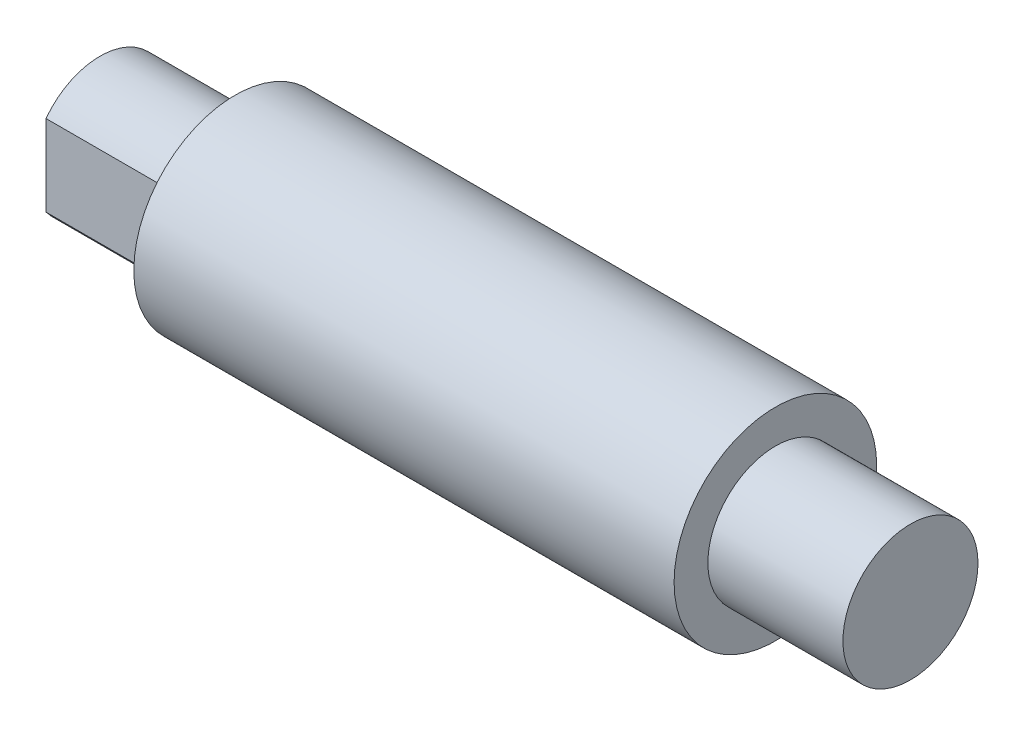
from build123d import *

# Parameters (mm, degrees)
SKETCH_1_R          = 7.5
EXTRUDE_1_DEPTH     = 60
SKETCH_2_OUTSIDE_W  = 29.728
SKETCH_2_OUTSIDE_H  = 29.728
SKETCH_2_OUTSIDE_R  = 5
CUT_EXTRUDE_1_DEPTH = 10
SKETCH_3_OUTSIDE_W  = 29.728
SKETCH_3_OUTSIDE_H  = 29.728
CUT_EXTRUDE_2_DEPTH = 10


with BuildPart() as part:
    # Sketch 1 → Extrude 1 (new body)
    with BuildSketch(Plane(origin=(0, 0, 0), x_dir=(0, 0, -1), z_dir=(1, 0, 0))):
        Circle(SKETCH_1_R)
    extrude(amount=EXTRUDE_1_DEPTH)

    # Sketch 2 outside → Cut-Extrude 1 (cut)
    with BuildSketch(Plane(origin=(60, 0, 0), x_dir=(0, 0, -1), z_dir=(1, 0, 0))):
        Rectangle(SKETCH_2_OUTSIDE_W, SKETCH_2_OUTSIDE_H)
        Circle(SKETCH_2_OUTSIDE_R, mode=Mode.SUBTRACT)
    extrude(amount=-CUT_EXTRUDE_1_DEPTH, mode=Mode.SUBTRACT)

    # Sketch 3 outside → Cut-Extrude 2 (cut)
    with BuildSketch(Plane.ZY):
        Rectangle(SKETCH_3_OUTSIDE_W, SKETCH_3_OUTSIDE_H)
        with BuildLine():
            Line((-4, 3), (-4, -3))
            ThreePointArc((-4, -3), (0, -5), (4, -3))
            Line((4, -3), (4, 3))
            ThreePointArc((4, 3), (0, 5), (-4, 3))
        make_face(mode=Mode.SUBTRACT)
    extrude(amount=-CUT_EXTRUDE_2_DEPTH, mode=Mode.SUBTRACT)


solid = part.part
